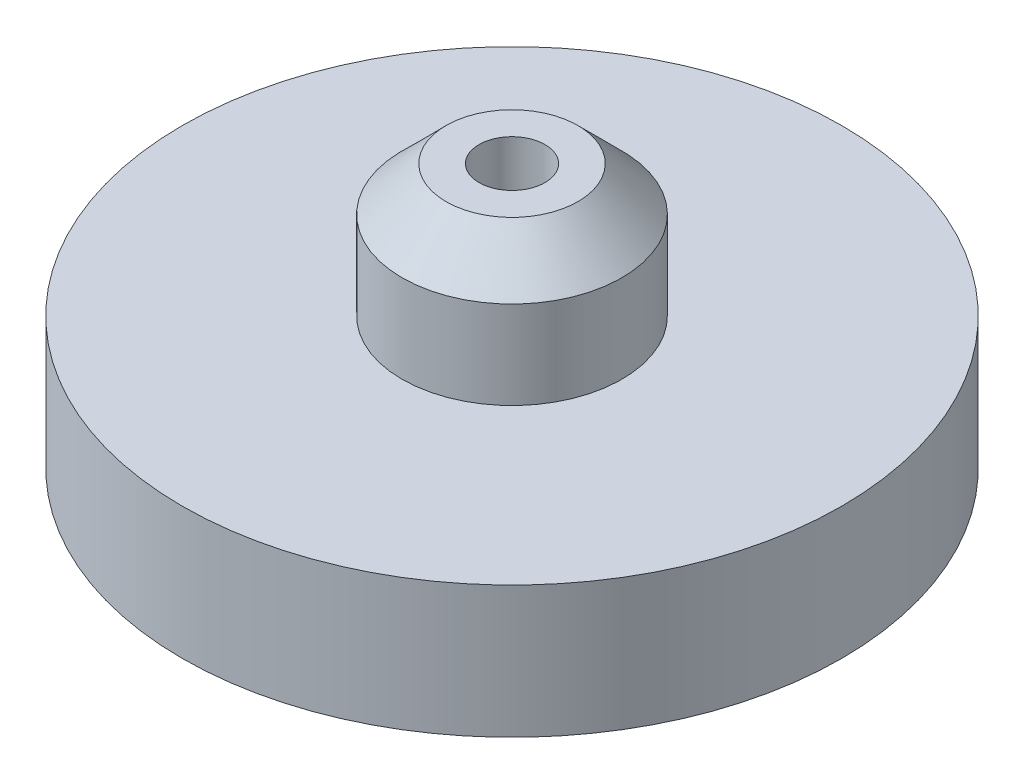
from build123d import *

# Parameters (mm, degrees)
SKETCH1_R          = 15
EXTRUDE1_DEPTH     = 6
SKETCH2_R          = 5
EXTRUDE2_DEPTH     = 6
CHAMFER1_SIZE      = 2
SKETCH3_R          = 1.5
CUT_EXTRUDE1_DEPTH = 25.372115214


with BuildPart() as part:
    # Sketch1 → Extrude1 (new body)
    with BuildSketch(Plane(origin=(0, 0, 0), x_dir=(1, 0, 0), z_dir=(0, 1, 0))):
        with Locations(Location((0, 0, 0), (0, 0, 270))):
            Circle(SKETCH1_R)
    extrude(amount=EXTRUDE1_DEPTH)

    # Sketch2 → Extrude2 (add)
    with BuildSketch(Plane(origin=(0, 6, 0), x_dir=(-1, 0, 0), z_dir=(0, 1, 0))):
        with Locations(Location((0, 0, 0), (0, 0, 90))):
            Circle(SKETCH2_R)
    extrude(amount=EXTRUDE2_DEPTH)

    # Chamfer1
    chamfer1_edges = [part.edges().sort_by_distance(p)[0] for p in [
        (0, 12, -5),
    ]]
    chamfer(chamfer1_edges, length=CHAMFER1_SIZE)

    # Sketch3 → Cut-Extrude1 (cut, through all)
    with BuildSketch(Plane(origin=(0, 12, 0), x_dir=(-1, 0, 0), z_dir=(0, 1, 0))):
        with Locations(Location((0, 0, 0), (0, 0, 90))):
            Circle(SKETCH3_R)
    extrude(amount=-CUT_EXTRUDE1_DEPTH, mode=Mode.SUBTRACT)


solid = part.part
